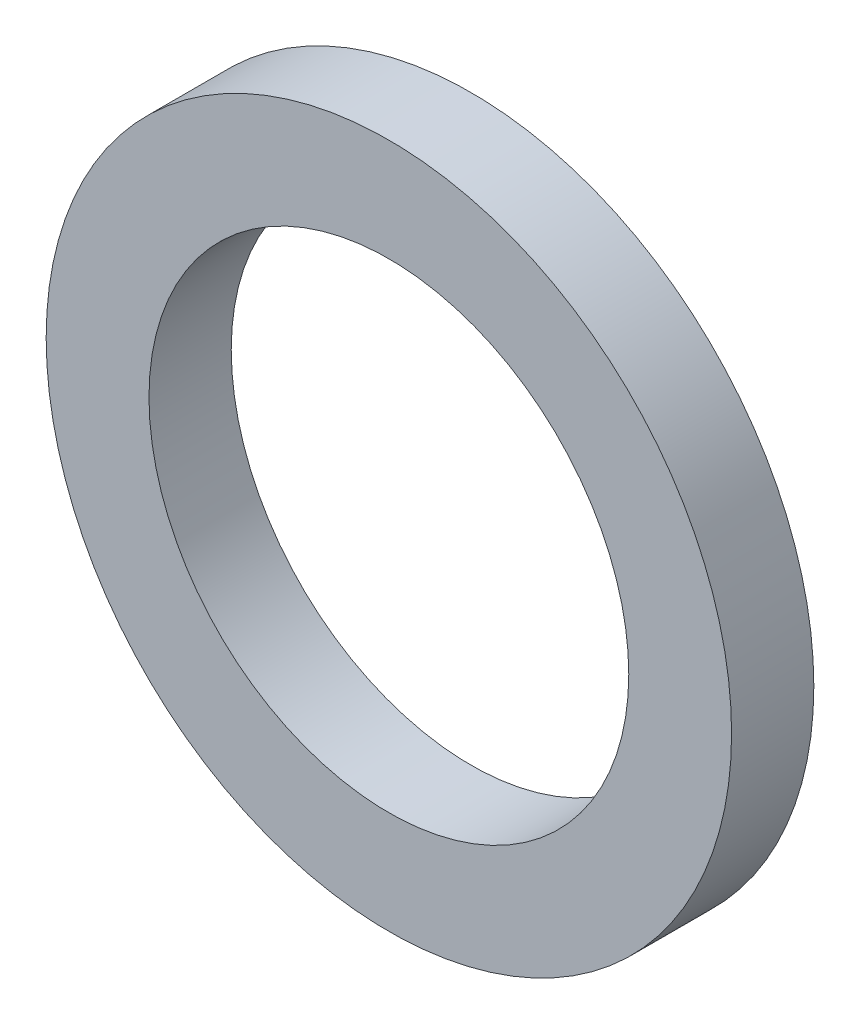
ISO-10303-21;
HEADER;
FILE_DESCRIPTION(('STEP AP214'),'2;1');
FILE_NAME('part.step','',(''),(''),'','','');
FILE_SCHEMA(('AUTOMOTIVE_DESIGN { 1 0 10303 214 1 1 1 1 }'));
ENDSEC;
DATA;
#1=APPLICATION_CONTEXT('core data for automotive mechanical design processes');
#2=APPLICATION_PROTOCOL_DEFINITION('international standard','automotive_design',2000,#1);
#3=PRODUCT_CONTEXT('',#1,'mechanical');
#4=PRODUCT('Part','Part','',(#3));
#5=PRODUCT_RELATED_PRODUCT_CATEGORY('part','',(#4));
#6=PRODUCT_DEFINITION_FORMATION('','',#4);
#7=PRODUCT_DEFINITION_CONTEXT('part definition',#1,'design');
#8=PRODUCT_DEFINITION('design','',#6,#7);
#9=PRODUCT_DEFINITION_SHAPE('','',#8);
#10=(LENGTH_UNIT() NAMED_UNIT(*) SI_UNIT(.MILLI.,.METRE.));
#11=(NAMED_UNIT(*) PLANE_ANGLE_UNIT() SI_UNIT($,.RADIAN.));
#12=(NAMED_UNIT(*) SI_UNIT($,.STERADIAN.) SOLID_ANGLE_UNIT());
#13=UNCERTAINTY_MEASURE_WITH_UNIT(LENGTH_MEASURE(1.E-05),#10,'distance_accuracy_value','');
#14=(GEOMETRIC_REPRESENTATION_CONTEXT(3) GLOBAL_UNCERTAINTY_ASSIGNED_CONTEXT((#13)) GLOBAL_UNIT_ASSIGNED_CONTEXT((#10,
#11,#12)) REPRESENTATION_CONTEXT('',''));
#15=CARTESIAN_POINT('',(0.,0.,0.));
#16=DIRECTION('',(0.,0.,1.));
#17=DIRECTION('',(1.,0.,0.));
#18=AXIS2_PLACEMENT_3D('',#15,#16,#17);
#19=CARTESIAN_POINT('',(0.,0.,1.2));
#20=DIRECTION('',(0.,0.,1.));
#21=DIRECTION('',(1.,0.,0.));
#22=AXIS2_PLACEMENT_3D('',#19,#20,#21);
#23=PLANE('',#22);
#24=CARTESIAN_POINT('',(0.,0.,1.2));
#25=DIRECTION('',(0.,0.,1.));
#26=DIRECTION('',(1.,0.,0.));
#27=AXIS2_PLACEMENT_3D('',#24,#25,#26);
#28=CIRCLE('',#27,5.);
#29=CARTESIAN_POINT('',(5.,0.,1.2));
#30=VERTEX_POINT('',#29);
#31=EDGE_CURVE('E10',#30,#30,#28,.T.);
#32=ORIENTED_EDGE('',*,*,#31,.T.);
#33=EDGE_LOOP('',(#32));
#34=FACE_BOUND('',#33,.T.);
#35=CARTESIAN_POINT('',(0.,0.,1.2));
#36=DIRECTION('',(0.,0.,1.));
#37=DIRECTION('',(1.,0.,0.));
#38=AXIS2_PLACEMENT_3D('',#35,#36,#37);
#39=CIRCLE('',#38,3.5);
#40=CARTESIAN_POINT('',(3.5,0.,1.2));
#41=VERTEX_POINT('',#40);
#42=EDGE_CURVE('E40',#41,#41,#39,.T.);
#43=ORIENTED_EDGE('',*,*,#42,.F.);
#44=EDGE_LOOP('',(#43));
#45=FACE_BOUND('',#44,.T.);
#46=ADVANCED_FACE('F29',(#34,#45),#23,.T.);
#47=CARTESIAN_POINT('',(0.,0.,0.));
#48=DIRECTION('',(0.,0.,1.));
#49=DIRECTION('',(1.,0.,0.));
#50=AXIS2_PLACEMENT_3D('',#47,#48,#49);
#51=PLANE('',#50);
#52=CARTESIAN_POINT('',(0.,0.,0.));
#53=DIRECTION('',(0.,0.,1.));
#54=DIRECTION('',(1.,0.,0.));
#55=AXIS2_PLACEMENT_3D('',#52,#53,#54);
#56=CIRCLE('',#55,5.);
#57=CARTESIAN_POINT('',(5.,0.,0.));
#58=VERTEX_POINT('',#57);
#59=EDGE_CURVE('E33',#58,#58,#56,.T.);
#60=ORIENTED_EDGE('',*,*,#59,.F.);
#61=EDGE_LOOP('',(#60));
#62=FACE_BOUND('',#61,.T.);
#63=CARTESIAN_POINT('',(0.,0.,0.));
#64=DIRECTION('',(0.,0.,1.));
#65=DIRECTION('',(1.,0.,0.));
#66=AXIS2_PLACEMENT_3D('',#63,#64,#65);
#67=CIRCLE('',#66,3.5);
#68=CARTESIAN_POINT('',(3.5,0.,0.));
#69=VERTEX_POINT('',#68);
#70=EDGE_CURVE('E42',#69,#69,#67,.T.);
#71=ORIENTED_EDGE('',*,*,#70,.T.);
#72=EDGE_LOOP('',(#71));
#73=FACE_BOUND('',#72,.T.);
#74=ADVANCED_FACE('F52',(#62,#73),#51,.F.);
#75=CARTESIAN_POINT('',(0.,0.,1.2));
#76=DIRECTION('',(0.,0.,-1.));
#77=DIRECTION('',(-1.,0.,0.));
#78=AXIS2_PLACEMENT_3D('',#75,#76,#77);
#79=CYLINDRICAL_SURFACE('',#78,5.);
#80=ORIENTED_EDGE('',*,*,#31,.F.);
#81=EDGE_LOOP('',(#80));
#82=FACE_BOUND('',#81,.T.);
#83=ORIENTED_EDGE('',*,*,#59,.T.);
#84=EDGE_LOOP('',(#83));
#85=FACE_BOUND('',#84,.T.);
#86=ADVANCED_FACE('F31',(#82,#85),#79,.T.);
#87=CARTESIAN_POINT('',(0.,0.,1.2));
#88=DIRECTION('',(0.,0.,-1.));
#89=DIRECTION('',(-1.,0.,0.));
#90=AXIS2_PLACEMENT_3D('',#87,#88,#89);
#91=CYLINDRICAL_SURFACE('',#90,3.5);
#92=ORIENTED_EDGE('',*,*,#42,.T.);
#93=EDGE_LOOP('',(#92));
#94=FACE_BOUND('',#93,.T.);
#95=ORIENTED_EDGE('',*,*,#70,.F.);
#96=EDGE_LOOP('',(#95));
#97=FACE_BOUND('',#96,.T.);
#98=ADVANCED_FACE('F48',(#94,#97),#91,.F.);
#99=CLOSED_SHELL('',(#46,#74,#86,#98));
#100=MANIFOLD_SOLID_BREP('B2',#99);
#101=ADVANCED_BREP_SHAPE_REPRESENTATION('',(#18,#100),#14);
#102=SHAPE_DEFINITION_REPRESENTATION(#9,#101);
ENDSEC;
END-ISO-10303-21;
